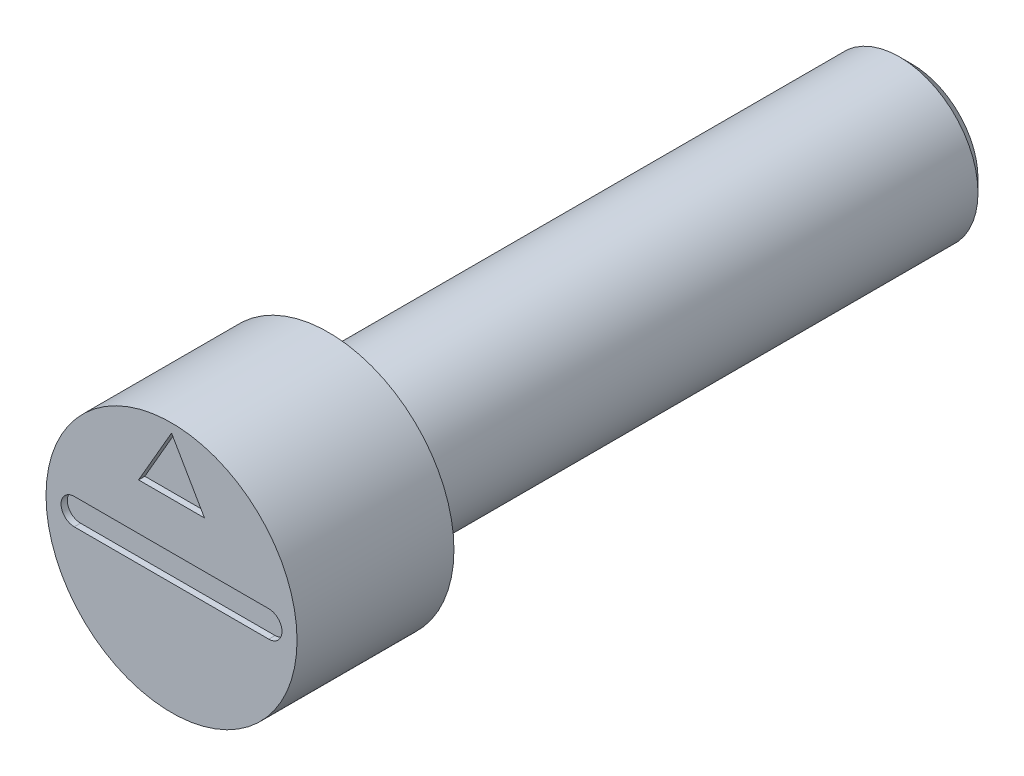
ISO-10303-21;
HEADER;
FILE_DESCRIPTION(('STEP AP214'),'2;1');
FILE_NAME('part.step','',(''),(''),'','','');
FILE_SCHEMA(('AUTOMOTIVE_DESIGN { 1 0 10303 214 1 1 1 1 }'));
ENDSEC;
DATA;
#1=APPLICATION_CONTEXT('core data for automotive mechanical design processes');
#2=APPLICATION_PROTOCOL_DEFINITION('international standard','automotive_design',2000,#1);
#3=PRODUCT_CONTEXT('',#1,'mechanical');
#4=PRODUCT('Part','Part','',(#3));
#5=PRODUCT_RELATED_PRODUCT_CATEGORY('part','',(#4));
#6=PRODUCT_DEFINITION_FORMATION('','',#4);
#7=PRODUCT_DEFINITION_CONTEXT('part definition',#1,'design');
#8=PRODUCT_DEFINITION('design','',#6,#7);
#9=PRODUCT_DEFINITION_SHAPE('','',#8);
#10=(LENGTH_UNIT() NAMED_UNIT(*) SI_UNIT(.MILLI.,.METRE.));
#11=(NAMED_UNIT(*) PLANE_ANGLE_UNIT() SI_UNIT($,.RADIAN.));
#12=(NAMED_UNIT(*) SI_UNIT($,.STERADIAN.) SOLID_ANGLE_UNIT());
#13=UNCERTAINTY_MEASURE_WITH_UNIT(LENGTH_MEASURE(1.E-05),#10,'distance_accuracy_value','');
#14=(GEOMETRIC_REPRESENTATION_CONTEXT(3) GLOBAL_UNCERTAINTY_ASSIGNED_CONTEXT((#13)) GLOBAL_UNIT_ASSIGNED_CONTEXT((#10,
#11,#12)) REPRESENTATION_CONTEXT('',''));
#15=CARTESIAN_POINT('',(0.,0.,0.));
#16=DIRECTION('',(0.,0.,1.));
#17=DIRECTION('',(1.,0.,0.));
#18=AXIS2_PLACEMENT_3D('',#15,#16,#17);
#19=CARTESIAN_POINT('',(0.999998,0.,0.));
#20=DIRECTION('',(0.,0.,1.));
#21=DIRECTION('',(1.,0.,0.));
#22=AXIS2_PLACEMENT_3D('',#19,#20,#21);
#23=PLANE('',#22);
#24=CARTESIAN_POINT('',(-1.55,0.,0.));
#25=DIRECTION('',(0.,0.,1.));
#26=DIRECTION('',(1.,0.,0.));
#27=AXIS2_PLACEMENT_3D('',#24,#25,#26);
#28=CIRCLE('',#27,0.21);
#29=CARTESIAN_POINT('',(-1.55,0.21,0.));
#30=VERTEX_POINT('',#29);
#31=CARTESIAN_POINT('',(-1.55,-0.21,0.));
#32=VERTEX_POINT('',#31);
#33=EDGE_CURVE('E58',#30,#32,#28,.T.);
#34=ORIENTED_EDGE('',*,*,#33,.F.);
#35=DIRECTION('',(-1.,0.,0.));
#36=VECTOR('',#35,1.);
#37=CARTESIAN_POINT('',(-1.55,0.21,0.));
#38=LINE('',#37,#36);
#39=CARTESIAN_POINT('',(1.55,0.21,0.));
#40=VERTEX_POINT('',#39);
#41=EDGE_CURVE('E122',#40,#30,#38,.T.);
#42=ORIENTED_EDGE('',*,*,#41,.F.);
#43=CARTESIAN_POINT('',(1.55,0.,0.));
#44=DIRECTION('',(0.,0.,1.));
#45=DIRECTION('',(1.,0.,0.));
#46=AXIS2_PLACEMENT_3D('',#43,#44,#45);
#47=CIRCLE('',#46,0.21);
#48=CARTESIAN_POINT('',(1.55,-0.21,0.));
#49=VERTEX_POINT('',#48);
#50=EDGE_CURVE('E125',#49,#40,#47,.T.);
#51=ORIENTED_EDGE('',*,*,#50,.F.);
#52=DIRECTION('',(1.,0.,0.));
#53=VECTOR('',#52,1.);
#54=CARTESIAN_POINT('',(-1.55,-0.21,0.));
#55=LINE('',#54,#53);
#56=EDGE_CURVE('E131',#32,#49,#55,.T.);
#57=ORIENTED_EDGE('',*,*,#56,.F.);
#58=EDGE_LOOP('',(#34,#42,#51,#57));
#59=FACE_BOUND('',#58,.T.);
#60=DIRECTION('',(-0.500000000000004,0.866025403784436,0.));
#61=VECTOR('',#60,1.);
#62=CARTESIAN_POINT('',(0.525000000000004,0.95,0.));
#63=LINE('',#62,#61);
#64=CARTESIAN_POINT('',(0.525000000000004,0.95,0.));
#65=VERTEX_POINT('',#64);
#66=CARTESIAN_POINT('',(0.,1.85932667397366,0.));
#67=VERTEX_POINT('',#66);
#68=EDGE_CURVE('E66',#65,#67,#63,.T.);
#69=ORIENTED_EDGE('',*,*,#68,.F.);
#70=DIRECTION('',(1.,0.,0.));
#71=VECTOR('',#70,1.);
#72=CARTESIAN_POINT('',(-0.525000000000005,0.95,0.));
#73=LINE('',#72,#71);
#74=CARTESIAN_POINT('',(-0.525000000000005,0.95,0.));
#75=VERTEX_POINT('',#74);
#76=EDGE_CURVE('E144',#75,#65,#73,.T.);
#77=ORIENTED_EDGE('',*,*,#76,.F.);
#78=DIRECTION('',(-0.500000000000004,-0.866025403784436,0.));
#79=VECTOR('',#78,1.);
#80=CARTESIAN_POINT('',(0.,1.85932667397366,0.));
#81=LINE('',#80,#79);
#82=EDGE_CURVE('E152',#67,#75,#81,.T.);
#83=ORIENTED_EDGE('',*,*,#82,.F.);
#84=EDGE_LOOP('',(#69,#77,#83));
#85=FACE_BOUND('',#84,.T.);
#86=CARTESIAN_POINT('',(0.,0.,0.));
#87=DIRECTION('',(0.,0.,-1.));
#88=DIRECTION('',(-1.,0.,0.));
#89=AXIS2_PLACEMENT_3D('',#86,#87,#88);
#90=CIRCLE('',#89,1.999996);
#91=CARTESIAN_POINT('',(-1.999996,0.,0.));
#92=VERTEX_POINT('',#91);
#93=EDGE_CURVE('E159',#92,#92,#90,.T.);
#94=ORIENTED_EDGE('',*,*,#93,.F.);
#95=EDGE_LOOP('',(#94));
#96=FACE_BOUND('',#95,.T.);
#97=ADVANCED_FACE('F41',(#59,#85,#96),#23,.T.);
#98=CARTESIAN_POINT('',(0.,0.,-1.499997));
#99=DIRECTION('',(0.,0.,-1.));
#100=DIRECTION('',(-1.,0.,0.));
#101=AXIS2_PLACEMENT_3D('',#98,#99,#100);
#102=CYLINDRICAL_SURFACE('',#101,1.999996);
#103=ORIENTED_EDGE('',*,*,#93,.T.);
#104=EDGE_LOOP('',(#103));
#105=FACE_BOUND('',#104,.T.);
#106=CARTESIAN_POINT('',(0.,0.,-2.499994));
#107=DIRECTION('',(0.,0.,-1.));
#108=DIRECTION('',(-1.,0.,0.));
#109=AXIS2_PLACEMENT_3D('',#106,#107,#108);
#110=CIRCLE('',#109,1.999996);
#111=CARTESIAN_POINT('',(-1.999996,0.,-2.499994));
#112=VERTEX_POINT('',#111);
#113=EDGE_CURVE('E45',#112,#112,#110,.T.);
#114=ORIENTED_EDGE('',*,*,#113,.F.);
#115=EDGE_LOOP('',(#114));
#116=FACE_BOUND('',#115,.T.);
#117=ADVANCED_FACE('F174',(#105,#116),#102,.T.);
#118=CARTESIAN_POINT('',(1.62499675,0.,-2.499994));
#119=DIRECTION('',(0.,0.,-1.));
#120=DIRECTION('',(-1.,0.,0.));
#121=AXIS2_PLACEMENT_3D('',#118,#119,#120);
#122=PLANE('',#121);
#123=CARTESIAN_POINT('',(0.,0.,-2.499994));
#124=DIRECTION('',(0.,0.,-1.));
#125=DIRECTION('',(-1.,0.,0.));
#126=AXIS2_PLACEMENT_3D('',#123,#124,#125);
#127=CIRCLE('',#126,1.2499975);
#128=CARTESIAN_POINT('',(-1.24999749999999,0.,-2.499994));
#129=VERTEX_POINT('',#128);
#130=EDGE_CURVE('E166',#129,#129,#127,.T.);
#131=ORIENTED_EDGE('',*,*,#130,.F.);
#132=EDGE_LOOP('',(#131));
#133=FACE_BOUND('',#132,.T.);
#134=ORIENTED_EDGE('',*,*,#113,.T.);
#135=EDGE_LOOP('',(#134));
#136=FACE_BOUND('',#135,.T.);
#137=ADVANCED_FACE('F43',(#133,#136),#122,.T.);
#138=CARTESIAN_POINT('',(0.,0.,-8.999982));
#139=DIRECTION('',(0.,0.,-1.));
#140=DIRECTION('',(-1.,0.,0.));
#141=AXIS2_PLACEMENT_3D('',#138,#139,#140);
#142=CYLINDRICAL_SURFACE('',#141,1.2499975);
#143=CARTESIAN_POINT('',(0.,0.,-11.6));
#144=DIRECTION('',(0.,0.,1.));
#145=DIRECTION('',(1.,0.,0.));
#146=AXIS2_PLACEMENT_3D('',#143,#144,#145);
#147=CIRCLE('',#146,1.2499975);
#148=CARTESIAN_POINT('',(1.24999750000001,0.,-11.6));
#149=VERTEX_POINT('',#148);
#150=EDGE_CURVE('E13',#149,#149,#147,.T.);
#151=ORIENTED_EDGE('',*,*,#150,.T.);
#152=EDGE_LOOP('',(#151));
#153=FACE_BOUND('',#152,.T.);
#154=ORIENTED_EDGE('',*,*,#130,.T.);
#155=EDGE_LOOP('',(#154));
#156=FACE_BOUND('',#155,.T.);
#157=ADVANCED_FACE('F182',(#153,#156),#142,.T.);
#158=CARTESIAN_POINT('',(0.525000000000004,0.95,-0.1));
#159=DIRECTION('',(0.866025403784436,0.500000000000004,0.));
#160=DIRECTION('',(-0.500000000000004,0.866025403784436,0.));
#161=AXIS2_PLACEMENT_3D('',#158,#159,#160);
#162=PLANE('',#161);
#163=ORIENTED_EDGE('',*,*,#68,.T.);
#164=DIRECTION('',(0.,0.,1.));
#165=VECTOR('',#164,1.);
#166=CARTESIAN_POINT('',(0.,1.85932667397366,-0.1));
#167=LINE('',#166,#165);
#168=CARTESIAN_POINT('',(0.,1.85932667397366,-0.1));
#169=VERTEX_POINT('',#168);
#170=EDGE_CURVE('E150',#169,#67,#167,.T.);
#171=ORIENTED_EDGE('',*,*,#170,.F.);
#172=DIRECTION('',(-0.500000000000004,0.866025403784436,0.));
#173=VECTOR('',#172,1.);
#174=CARTESIAN_POINT('',(0.525000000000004,0.95,-0.1));
#175=LINE('',#174,#173);
#176=CARTESIAN_POINT('',(0.525000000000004,0.95,-0.1));
#177=VERTEX_POINT('',#176);
#178=EDGE_CURVE('E140',#177,#169,#175,.T.);
#179=ORIENTED_EDGE('',*,*,#178,.F.);
#180=DIRECTION('',(0.,0.,1.));
#181=VECTOR('',#180,1.);
#182=CARTESIAN_POINT('',(0.525000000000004,0.95,-0.1));
#183=LINE('',#182,#181);
#184=EDGE_CURVE('E157',#177,#65,#183,.T.);
#185=ORIENTED_EDGE('',*,*,#184,.T.);
#186=EDGE_LOOP('',(#163,#171,#179,#185));
#187=FACE_BOUND('',#186,.T.);
#188=ADVANCED_FACE('F186',(#187),#162,.F.);
#189=CARTESIAN_POINT('',(-0.525000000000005,0.95,-0.1));
#190=DIRECTION('',(0.,-1.,0.));
#191=DIRECTION('',(1.,0.,0.));
#192=AXIS2_PLACEMENT_3D('',#189,#190,#191);
#193=PLANE('',#192);
#194=ORIENTED_EDGE('',*,*,#76,.T.);
#195=ORIENTED_EDGE('',*,*,#184,.F.);
#196=DIRECTION('',(1.,0.,0.));
#197=VECTOR('',#196,1.);
#198=CARTESIAN_POINT('',(-0.525000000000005,0.95,-0.1));
#199=LINE('',#198,#197);
#200=CARTESIAN_POINT('',(-0.525000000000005,0.95,-0.1));
#201=VERTEX_POINT('',#200);
#202=EDGE_CURVE('E147',#201,#177,#199,.T.);
#203=ORIENTED_EDGE('',*,*,#202,.F.);
#204=DIRECTION('',(0.,0.,1.));
#205=VECTOR('',#204,1.);
#206=CARTESIAN_POINT('',(-0.525000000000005,0.95,-0.1));
#207=LINE('',#206,#205);
#208=EDGE_CURVE('E160',#201,#75,#207,.T.);
#209=ORIENTED_EDGE('',*,*,#208,.T.);
#210=EDGE_LOOP('',(#194,#195,#203,#209));
#211=FACE_BOUND('',#210,.T.);
#212=ADVANCED_FACE('F193',(#211),#193,.F.);
#213=CARTESIAN_POINT('',(0.,1.85932667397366,-0.1));
#214=DIRECTION('',(-0.866025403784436,0.500000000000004,0.));
#215=DIRECTION('',(-0.500000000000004,-0.866025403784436,0.));
#216=AXIS2_PLACEMENT_3D('',#213,#214,#215);
#217=PLANE('',#216);
#218=ORIENTED_EDGE('',*,*,#82,.T.);
#219=ORIENTED_EDGE('',*,*,#208,.F.);
#220=DIRECTION('',(-0.500000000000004,-0.866025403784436,0.));
#221=VECTOR('',#220,1.);
#222=CARTESIAN_POINT('',(0.,1.85932667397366,-0.1));
#223=LINE('',#222,#221);
#224=EDGE_CURVE('E143',#169,#201,#223,.T.);
#225=ORIENTED_EDGE('',*,*,#224,.F.);
#226=ORIENTED_EDGE('',*,*,#170,.T.);
#227=EDGE_LOOP('',(#218,#219,#225,#226));
#228=FACE_BOUND('',#227,.T.);
#229=ADVANCED_FACE('F196',(#228),#217,.F.);
#230=CARTESIAN_POINT('',(0.,0.,-0.1));
#231=DIRECTION('',(0.,0.,1.));
#232=DIRECTION('',(1.,0.,0.));
#233=AXIS2_PLACEMENT_3D('',#230,#231,#232);
#234=PLANE('',#233);
#235=ORIENTED_EDGE('',*,*,#178,.T.);
#236=ORIENTED_EDGE('',*,*,#224,.T.);
#237=ORIENTED_EDGE('',*,*,#202,.T.);
#238=EDGE_LOOP('',(#235,#236,#237));
#239=FACE_BOUND('',#238,.T.);
#240=ADVANCED_FACE('F199',(#239),#234,.T.);
#241=CARTESIAN_POINT('',(-1.55,0.,-0.1));
#242=DIRECTION('',(0.,0.,1.));
#243=DIRECTION('',(1.,0.,0.));
#244=AXIS2_PLACEMENT_3D('',#241,#242,#243);
#245=CYLINDRICAL_SURFACE('',#244,0.21);
#246=ORIENTED_EDGE('',*,*,#33,.T.);
#247=DIRECTION('',(0.,0.,1.));
#248=VECTOR('',#247,1.);
#249=CARTESIAN_POINT('',(-1.55,-0.21,-0.1));
#250=LINE('',#249,#248);
#251=CARTESIAN_POINT('',(-1.55,-0.21,-0.1));
#252=VERTEX_POINT('',#251);
#253=EDGE_CURVE('E100',#252,#32,#250,.T.);
#254=ORIENTED_EDGE('',*,*,#253,.F.);
#255=CARTESIAN_POINT('',(-1.55,0.,-0.1));
#256=DIRECTION('',(0.,0.,1.));
#257=DIRECTION('',(1.,0.,0.));
#258=AXIS2_PLACEMENT_3D('',#255,#256,#257);
#259=CIRCLE('',#258,0.21);
#260=CARTESIAN_POINT('',(-1.55,0.21,-0.1));
#261=VERTEX_POINT('',#260);
#262=EDGE_CURVE('E104',#261,#252,#259,.T.);
#263=ORIENTED_EDGE('',*,*,#262,.F.);
#264=DIRECTION('',(0.,0.,1.));
#265=VECTOR('',#264,1.);
#266=CARTESIAN_POINT('',(-1.55,0.21,-0.1));
#267=LINE('',#266,#265);
#268=EDGE_CURVE('E135',#261,#30,#267,.T.);
#269=ORIENTED_EDGE('',*,*,#268,.T.);
#270=EDGE_LOOP('',(#246,#254,#263,#269));
#271=FACE_BOUND('',#270,.T.);
#272=ADVANCED_FACE('F102',(#271),#245,.F.);
#273=CARTESIAN_POINT('',(-1.55,0.21,-0.1));
#274=DIRECTION('',(0.,1.,0.));
#275=DIRECTION('',(0.,0.,1.));
#276=AXIS2_PLACEMENT_3D('',#273,#274,#275);
#277=PLANE('',#276);
#278=ORIENTED_EDGE('',*,*,#41,.T.);
#279=ORIENTED_EDGE('',*,*,#268,.F.);
#280=DIRECTION('',(-1.,0.,0.));
#281=VECTOR('',#280,1.);
#282=CARTESIAN_POINT('',(-1.55,0.21,-0.1));
#283=LINE('',#282,#281);
#284=CARTESIAN_POINT('',(1.55,0.21,-0.1));
#285=VERTEX_POINT('',#284);
#286=EDGE_CURVE('E110',#285,#261,#283,.T.);
#287=ORIENTED_EDGE('',*,*,#286,.F.);
#288=DIRECTION('',(0.,0.,1.));
#289=VECTOR('',#288,1.);
#290=CARTESIAN_POINT('',(1.55,0.21,-0.1));
#291=LINE('',#290,#289);
#292=EDGE_CURVE('E137',#285,#40,#291,.T.);
#293=ORIENTED_EDGE('',*,*,#292,.T.);
#294=EDGE_LOOP('',(#278,#279,#287,#293));
#295=FACE_BOUND('',#294,.T.);
#296=ADVANCED_FACE('F209',(#295),#277,.F.);
#297=CARTESIAN_POINT('',(1.55,0.,-0.1));
#298=DIRECTION('',(0.,0.,1.));
#299=DIRECTION('',(1.,0.,0.));
#300=AXIS2_PLACEMENT_3D('',#297,#298,#299);
#301=CYLINDRICAL_SURFACE('',#300,0.21);
#302=ORIENTED_EDGE('',*,*,#50,.T.);
#303=ORIENTED_EDGE('',*,*,#292,.F.);
#304=CARTESIAN_POINT('',(1.55,0.,-0.1));
#305=DIRECTION('',(0.,0.,1.));
#306=DIRECTION('',(1.,0.,0.));
#307=AXIS2_PLACEMENT_3D('',#304,#305,#306);
#308=CIRCLE('',#307,0.21);
#309=CARTESIAN_POINT('',(1.55,-0.21,-0.1));
#310=VERTEX_POINT('',#309);
#311=EDGE_CURVE('E118',#310,#285,#308,.T.);
#312=ORIENTED_EDGE('',*,*,#311,.F.);
#313=DIRECTION('',(0.,0.,1.));
#314=VECTOR('',#313,1.);
#315=CARTESIAN_POINT('',(1.55,-0.21,-0.1));
#316=LINE('',#315,#314);
#317=EDGE_CURVE('E109',#310,#49,#316,.T.);
#318=ORIENTED_EDGE('',*,*,#317,.T.);
#319=EDGE_LOOP('',(#302,#303,#312,#318));
#320=FACE_BOUND('',#319,.T.);
#321=ADVANCED_FACE('F212',(#320),#301,.F.);
#322=CARTESIAN_POINT('',(-1.55,-0.21,-0.1));
#323=DIRECTION('',(0.,-1.,0.));
#324=DIRECTION('',(0.,0.,-1.));
#325=AXIS2_PLACEMENT_3D('',#322,#323,#324);
#326=PLANE('',#325);
#327=ORIENTED_EDGE('',*,*,#56,.T.);
#328=ORIENTED_EDGE('',*,*,#317,.F.);
#329=DIRECTION('',(1.,0.,0.));
#330=VECTOR('',#329,1.);
#331=CARTESIAN_POINT('',(-1.55,-0.21,-0.1));
#332=LINE('',#331,#330);
#333=EDGE_CURVE('E113',#252,#310,#332,.T.);
#334=ORIENTED_EDGE('',*,*,#333,.F.);
#335=ORIENTED_EDGE('',*,*,#253,.T.);
#336=EDGE_LOOP('',(#327,#328,#334,#335));
#337=FACE_BOUND('',#336,.T.);
#338=ADVANCED_FACE('F114',(#337),#326,.F.);
#339=CARTESIAN_POINT('',(-1.55,0.,-0.1));
#340=DIRECTION('',(0.,0.,1.));
#341=DIRECTION('',(1.,0.,0.));
#342=AXIS2_PLACEMENT_3D('',#339,#340,#341);
#343=PLANE('',#342);
#344=ORIENTED_EDGE('',*,*,#262,.T.);
#345=ORIENTED_EDGE('',*,*,#333,.T.);
#346=ORIENTED_EDGE('',*,*,#311,.T.);
#347=ORIENTED_EDGE('',*,*,#286,.T.);
#348=EDGE_LOOP('',(#344,#345,#346,#347));
#349=FACE_BOUND('',#348,.T.);
#350=ADVANCED_FACE('F120',(#349),#343,.T.);
#351=CARTESIAN_POINT('',(0.999998,0.,-11.8));
#352=DIRECTION('',(0.,0.,1.));
#353=DIRECTION('',(1.,0.,0.));
#354=AXIS2_PLACEMENT_3D('',#351,#352,#353);
#355=PLANE('',#354);
#356=CARTESIAN_POINT('',(0.,0.,-11.8));
#357=DIRECTION('',(0.,0.,1.));
#358=DIRECTION('',(1.,0.,0.));
#359=AXIS2_PLACEMENT_3D('',#356,#357,#358);
#360=CIRCLE('',#359,1.0499975);
#361=CARTESIAN_POINT('',(1.04999750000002,0.,-11.8));
#362=VERTEX_POINT('',#361);
#363=EDGE_CURVE('E50',#362,#362,#360,.F.);
#364=ORIENTED_EDGE('',*,*,#363,.T.);
#365=EDGE_LOOP('',(#364));
#366=FACE_BOUND('',#365,.T.);
#367=ADVANCED_FACE('F221',(#366),#355,.F.);
#368=CARTESIAN_POINT('',(0.,0.,-11.8));
#369=DIRECTION('',(0.,0.,1.));
#370=DIRECTION('',(1.,0.,0.));
#371=AXIS2_PLACEMENT_3D('',#368,#369,#370);
#372=CONICAL_SURFACE('',#371,1.0499975,0.785398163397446);
#373=ORIENTED_EDGE('',*,*,#150,.F.);
#374=EDGE_LOOP('',(#373));
#375=FACE_BOUND('',#374,.T.);
#376=ORIENTED_EDGE('',*,*,#363,.F.);
#377=EDGE_LOOP('',(#376));
#378=FACE_BOUND('',#377,.T.);
#379=ADVANCED_FACE('F223',(#375,#378),#372,.T.);
#380=CLOSED_SHELL('',(#97,#117,#137,#157,#188,#212,#229,#240,#272,#296,#321,#338,#350,#367,#379));
#381=MANIFOLD_SOLID_BREP('B2',#380);
#382=ADVANCED_BREP_SHAPE_REPRESENTATION('',(#18,#381),#14);
#383=SHAPE_DEFINITION_REPRESENTATION(#9,#382);
ENDSEC;
END-ISO-10303-21;
